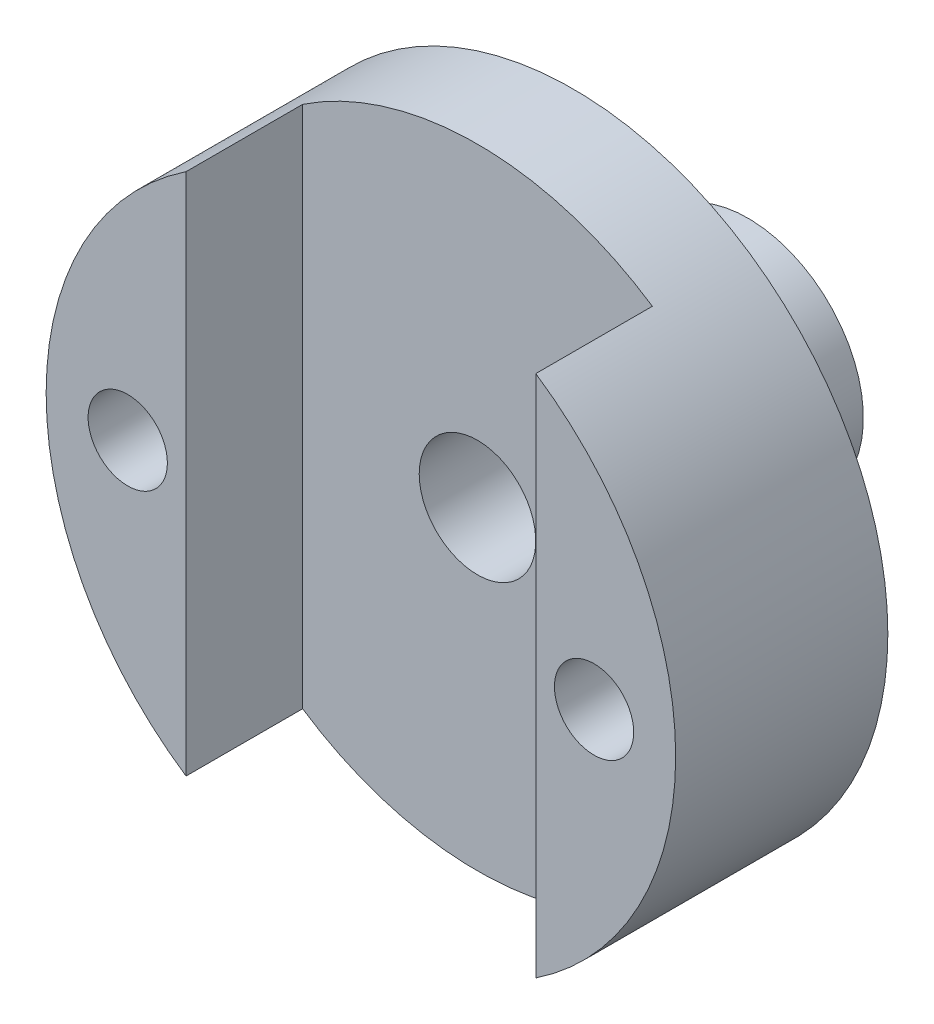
ISO-10303-21;
HEADER;
FILE_DESCRIPTION(('STEP AP214'),'2;1');
FILE_NAME('part.step','',(''),(''),'','','');
FILE_SCHEMA(('AUTOMOTIVE_DESIGN { 1 0 10303 214 1 1 1 1 }'));
ENDSEC;
DATA;
#1=APPLICATION_CONTEXT('core data for automotive mechanical design processes');
#2=APPLICATION_PROTOCOL_DEFINITION('international standard','automotive_design',2000,#1);
#3=PRODUCT_CONTEXT('',#1,'mechanical');
#4=PRODUCT('Part','Part','',(#3));
#5=PRODUCT_RELATED_PRODUCT_CATEGORY('part','',(#4));
#6=PRODUCT_DEFINITION_FORMATION('','',#4);
#7=PRODUCT_DEFINITION_CONTEXT('part definition',#1,'design');
#8=PRODUCT_DEFINITION('design','',#6,#7);
#9=PRODUCT_DEFINITION_SHAPE('','',#8);
#10=(LENGTH_UNIT() NAMED_UNIT(*) SI_UNIT(.MILLI.,.METRE.));
#11=(NAMED_UNIT(*) PLANE_ANGLE_UNIT() SI_UNIT($,.RADIAN.));
#12=(NAMED_UNIT(*) SI_UNIT($,.STERADIAN.) SOLID_ANGLE_UNIT());
#13=UNCERTAINTY_MEASURE_WITH_UNIT(LENGTH_MEASURE(1.E-05),#10,'distance_accuracy_value','');
#14=(GEOMETRIC_REPRESENTATION_CONTEXT(3) GLOBAL_UNCERTAINTY_ASSIGNED_CONTEXT((#13)) GLOBAL_UNIT_ASSIGNED_CONTEXT((#10,
#11,#12)) REPRESENTATION_CONTEXT('',''));
#15=CARTESIAN_POINT('',(0.,0.,0.));
#16=DIRECTION('',(0.,0.,1.));
#17=DIRECTION('',(1.,0.,0.));
#18=AXIS2_PLACEMENT_3D('',#15,#16,#17);
#19=CARTESIAN_POINT('',(0.,0.,9.525));
#20=DIRECTION('',(0.,0.,-1.));
#21=DIRECTION('',(-1.,0.,0.));
#22=AXIS2_PLACEMENT_3D('',#19,#20,#21);
#23=CYLINDRICAL_SURFACE('',#22,3.175);
#24=CARTESIAN_POINT('',(0.,0.,0.));
#25=DIRECTION('',(0.,0.,1.));
#26=DIRECTION('',(1.,0.,0.));
#27=AXIS2_PLACEMENT_3D('',#24,#25,#26);
#28=CIRCLE('',#27,3.175);
#29=CARTESIAN_POINT('',(-3.175,0.,0.));
#30=VERTEX_POINT('',#29);
#31=EDGE_CURVE('E123',#30,#30,#28,.T.);
#32=CARTESIAN_POINT('',(0.,0.,14.732));
#33=DIRECTION('',(0.,0.,1.));
#34=DIRECTION('',(1.,0.,0.));
#35=AXIS2_PLACEMENT_3D('',#32,#33,#34);
#36=CIRCLE('',#35,3.175);
#37=CARTESIAN_POINT('',(-3.175,0.,14.732));
#38=VERTEX_POINT('',#37);
#39=EDGE_CURVE('E115',#38,#38,#36,.T.);
#40=CARTESIAN_POINT('',(-3.175,0.,0.));
#41=CARTESIAN_POINT('',(-3.175,0.,0.153458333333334));
#42=CARTESIAN_POINT('',(-3.175,0.,0.306916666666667));
#43=CARTESIAN_POINT('',(-3.175,0.,0.613833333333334));
#44=CARTESIAN_POINT('',(-3.175,0.,0.767291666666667));
#45=CARTESIAN_POINT('',(-3.175,0.,1.07420833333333));
#46=CARTESIAN_POINT('',(-3.175,0.,1.22766666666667));
#47=CARTESIAN_POINT('',(-3.175,0.,1.53458333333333));
#48=CARTESIAN_POINT('',(-3.175,0.,1.68804166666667));
#49=CARTESIAN_POINT('',(-3.175,0.,1.99495833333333));
#50=CARTESIAN_POINT('',(-3.175,0.,2.14841666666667));
#51=CARTESIAN_POINT('',(-3.175,0.,2.45533333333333));
#52=CARTESIAN_POINT('',(-3.175,0.,2.60879166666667));
#53=CARTESIAN_POINT('',(-3.175,0.,2.91570833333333));
#54=CARTESIAN_POINT('',(-3.175,0.,3.06916666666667));
#55=CARTESIAN_POINT('',(-3.175,0.,3.37608333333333));
#56=CARTESIAN_POINT('',(-3.175,0.,3.52954166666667));
#57=CARTESIAN_POINT('',(-3.175,0.,3.83645833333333));
#58=CARTESIAN_POINT('',(-3.175,0.,3.98991666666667));
#59=CARTESIAN_POINT('',(-3.175,0.,4.29683333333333));
#60=CARTESIAN_POINT('',(-3.175,0.,4.45029166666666));
#61=CARTESIAN_POINT('',(-3.175,0.,4.75720833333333));
#62=CARTESIAN_POINT('',(-3.175,0.,4.91066666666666));
#63=CARTESIAN_POINT('',(-3.175,0.,5.21758333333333));
#64=CARTESIAN_POINT('',(-3.175,0.,5.37104166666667));
#65=CARTESIAN_POINT('',(-3.175,0.,5.67795833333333));
#66=CARTESIAN_POINT('',(-3.175,0.,5.83141666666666));
#67=CARTESIAN_POINT('',(-3.175,0.,6.13833333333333));
#68=CARTESIAN_POINT('',(-3.175,0.,6.29179166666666));
#69=CARTESIAN_POINT('',(-3.175,0.,6.59870833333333));
#70=CARTESIAN_POINT('',(-3.175,0.,6.75216666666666));
#71=CARTESIAN_POINT('',(-3.175,0.,7.05908333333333));
#72=CARTESIAN_POINT('',(-3.175,0.,7.21254166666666));
#73=CARTESIAN_POINT('',(-3.175,0.,7.51945833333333));
#74=CARTESIAN_POINT('',(-3.175,0.,7.67291666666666));
#75=CARTESIAN_POINT('',(-3.175,0.,7.97983333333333));
#76=CARTESIAN_POINT('',(-3.175,0.,8.13329166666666));
#77=CARTESIAN_POINT('',(-3.175,0.,8.44020833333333));
#78=CARTESIAN_POINT('',(-3.175,0.,8.59366666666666));
#79=CARTESIAN_POINT('',(-3.175,0.,8.90058333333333));
#80=CARTESIAN_POINT('',(-3.175,0.,9.05404166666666));
#81=CARTESIAN_POINT('',(-3.175,0.,9.36095833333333));
#82=CARTESIAN_POINT('',(-3.175,0.,9.51441666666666));
#83=CARTESIAN_POINT('',(-3.175,0.,9.82133333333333));
#84=CARTESIAN_POINT('',(-3.175,0.,9.97479166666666));
#85=CARTESIAN_POINT('',(-3.175,0.,10.2817083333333));
#86=CARTESIAN_POINT('',(-3.175,0.,10.4351666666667));
#87=CARTESIAN_POINT('',(-3.175,0.,10.7420833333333));
#88=CARTESIAN_POINT('',(-3.175,0.,10.8955416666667));
#89=CARTESIAN_POINT('',(-3.175,0.,11.2024583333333));
#90=CARTESIAN_POINT('',(-3.175,0.,11.3559166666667));
#91=CARTESIAN_POINT('',(-3.175,0.,11.6628333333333));
#92=CARTESIAN_POINT('',(-3.175,0.,11.8162916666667));
#93=CARTESIAN_POINT('',(-3.175,0.,12.1232083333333));
#94=CARTESIAN_POINT('',(-3.175,0.,12.2766666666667));
#95=CARTESIAN_POINT('',(-3.175,0.,12.5835833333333));
#96=CARTESIAN_POINT('',(-3.175,0.,12.7370416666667));
#97=CARTESIAN_POINT('',(-3.175,0.,13.0439583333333));
#98=CARTESIAN_POINT('',(-3.175,0.,13.1974166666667));
#99=CARTESIAN_POINT('',(-3.175,0.,13.5043333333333));
#100=CARTESIAN_POINT('',(-3.175,0.,13.6577916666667));
#101=CARTESIAN_POINT('',(-3.175,0.,13.9647083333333));
#102=CARTESIAN_POINT('',(-3.175,0.,14.1181666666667));
#103=CARTESIAN_POINT('',(-3.175,0.,14.4250833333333));
#104=CARTESIAN_POINT('',(-3.175,0.,14.5785416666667));
#105=CARTESIAN_POINT('',(-3.175,0.,14.732));
#106=B_SPLINE_CURVE_WITH_KNOTS('',3,(#40,#41,#42,#43,#44,#45,#46,#47,#48,#49,#50,#51,#52,#53,
#54,#55,#56,#57,#58,#59,#60,#61,#62,#63,#64,#65,#66,#67,#68,#69,#70,#71,#72,#73,#74,#75,#76,#77,
#78,#79,#80,#81,#82,#83,#84,#85,#86,#87,#88,#89,#90,#91,#92,#93,#94,#95,#96,#97,#98,#99,#100,
#101,#102,#103,#104,#105),.UNSPECIFIED.,.F.,.F.,(4,2,2,2,2,2,2,2,2,2,2,2,2,2,2,2,2,2,2,2,2,2,2,
2,2,2,2,2,2,2,2,2,4),(0.,0.460375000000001,0.92075,1.381125,1.8415,2.301875,2.76225,3.222625,
3.683,4.143375,4.60375,5.064125,5.5245,5.984875,6.44525,6.905625,7.366,7.826375,8.28675,
8.747125,9.2075,9.667875,10.12825,10.588625,11.049,11.509375,11.96975,12.430125,12.8905,
13.350875,13.81125,14.271625,14.732),.UNSPECIFIED.);
#107=EDGE_CURVE('BSEAM39',#30,#38,#106,.T.);
#108=ORIENTED_EDGE('',*,*,#31,.F.);
#109=ORIENTED_EDGE('',*,*,#39,.T.);
#110=ORIENTED_EDGE('',*,*,#107,.T.);
#111=ORIENTED_EDGE('',*,*,#107,.F.);
#112=EDGE_LOOP('',(#108,#110,#109,#111));
#113=FACE_BOUND('',#112,.T.);
#114=ADVANCED_FACE('F39',(#113),#23,.F.);
#115=CARTESIAN_POINT('',(0.,0.,21.082));
#116=DIRECTION('',(0.,0.,1.));
#117=DIRECTION('',(1.,0.,0.));
#118=AXIS2_PLACEMENT_3D('',#115,#116,#117);
#119=PLANE('',#118);
#120=CARTESIAN_POINT('',(-12.7,0.,21.082));
#121=DIRECTION('',(0.,0.,1.));
#122=DIRECTION('',(1.,0.,0.));
#123=AXIS2_PLACEMENT_3D('',#120,#121,#122);
#124=CIRCLE('',#123,2.159);
#125=CARTESIAN_POINT('',(-10.541,0.,21.082));
#126=VERTEX_POINT('',#125);
#127=EDGE_CURVE('E298',#126,#126,#124,.T.);
#128=ORIENTED_EDGE('',*,*,#127,.F.);
#129=EDGE_LOOP('',(#128));
#130=FACE_BOUND('',#129,.T.);
#131=CARTESIAN_POINT('',(0.,0.,21.082));
#132=DIRECTION('',(0.,0.,1.));
#133=DIRECTION('',(1.,0.,0.));
#134=AXIS2_PLACEMENT_3D('',#131,#132,#133);
#135=CIRCLE('',#134,17.145);
#136=CARTESIAN_POINT('',(-9.525,14.2557146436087,21.082));
#137=VERTEX_POINT('',#136);
#138=CARTESIAN_POINT('',(-9.525,-14.2557146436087,21.082));
#139=VERTEX_POINT('',#138);
#140=EDGE_CURVE('E83',#137,#139,#135,.T.);
#141=ORIENTED_EDGE('',*,*,#140,.T.);
#142=DIRECTION('',(0.,1.,0.));
#143=VECTOR('',#142,1.);
#144=CARTESIAN_POINT('',(-9.525,-66.0972168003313,21.082));
#145=LINE('',#144,#143);
#146=EDGE_CURVE('E113',#139,#137,#145,.T.);
#147=ORIENTED_EDGE('',*,*,#146,.T.);
#148=EDGE_LOOP('',(#141,#147));
#149=FACE_BOUND('',#148,.T.);
#150=ADVANCED_FACE('F136',(#130,#149),#119,.T.);
#151=CARTESIAN_POINT('',(12.7,0.,21.082));
#152=DIRECTION('',(0.,0.,1.));
#153=DIRECTION('',(1.,0.,0.));
#154=AXIS2_PLACEMENT_3D('',#151,#152,#153);
#155=CIRCLE('',#154,2.159);
#156=CARTESIAN_POINT('',(14.859,0.,21.082));
#157=VERTEX_POINT('',#156);
#158=EDGE_CURVE('E297',#157,#157,#155,.T.);
#159=ORIENTED_EDGE('',*,*,#158,.F.);
#160=EDGE_LOOP('',(#159));
#161=FACE_BOUND('',#160,.T.);
#162=CARTESIAN_POINT('',(9.525,-14.2557146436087,21.082));
#163=VERTEX_POINT('',#162);
#164=CARTESIAN_POINT('',(9.525,14.2557146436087,21.082));
#165=VERTEX_POINT('',#164);
#166=EDGE_CURVE('E74',#163,#165,#135,.T.);
#167=ORIENTED_EDGE('',*,*,#166,.T.);
#168=DIRECTION('',(0.,1.,0.));
#169=VECTOR('',#168,1.);
#170=CARTESIAN_POINT('',(9.525,-66.0972168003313,21.082));
#171=LINE('',#170,#169);
#172=EDGE_CURVE('E86',#163,#165,#171,.T.);
#173=ORIENTED_EDGE('',*,*,#172,.F.);
#174=EDGE_LOOP('',(#167,#173));
#175=FACE_BOUND('',#174,.T.);
#176=ADVANCED_FACE('F87',(#161,#175),#119,.T.);
#177=CARTESIAN_POINT('',(0.,0.,21.082));
#178=DIRECTION('',(0.,0.,-1.));
#179=DIRECTION('',(-1.,0.,0.));
#180=AXIS2_PLACEMENT_3D('',#177,#178,#179);
#181=CYLINDRICAL_SURFACE('',#180,17.145);
#182=CARTESIAN_POINT('',(0.,0.,9.525));
#183=DIRECTION('',(0.,0.,1.));
#184=DIRECTION('',(1.,0.,0.));
#185=AXIS2_PLACEMENT_3D('',#182,#183,#184);
#186=CIRCLE('',#185,17.145);
#187=CARTESIAN_POINT('',(17.145,0.,9.525));
#188=VERTEX_POINT('',#187);
#189=EDGE_CURVE('E84',#188,#188,#186,.T.);
#190=ORIENTED_EDGE('',*,*,#189,.T.);
#191=EDGE_LOOP('',(#190));
#192=FACE_BOUND('',#191,.T.);
#193=DIRECTION('',(0.,0.,-1.));
#194=VECTOR('',#193,1.);
#195=CARTESIAN_POINT('',(-9.525,14.2557146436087,21.082));
#196=LINE('',#195,#194);
#197=CARTESIAN_POINT('',(-9.525,14.2557146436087,14.732));
#198=VERTEX_POINT('',#197);
#199=EDGE_CURVE('E11',#198,#137,#196,.F.);
#200=ORIENTED_EDGE('',*,*,#199,.F.);
#201=CARTESIAN_POINT('',(0.,0.,14.732));
#202=DIRECTION('',(0.,0.,1.));
#203=DIRECTION('',(1.,0.,0.));
#204=AXIS2_PLACEMENT_3D('',#201,#202,#203);
#205=CIRCLE('',#204,17.145);
#206=CARTESIAN_POINT('',(9.525,14.2557146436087,14.732));
#207=VERTEX_POINT('',#206);
#208=EDGE_CURVE('E47',#207,#198,#205,.T.);
#209=ORIENTED_EDGE('',*,*,#208,.F.);
#210=DIRECTION('',(0.,0.,-1.));
#211=VECTOR('',#210,1.);
#212=CARTESIAN_POINT('',(9.525,14.2557146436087,21.082));
#213=LINE('',#212,#211);
#214=EDGE_CURVE('E80',#165,#207,#213,.T.);
#215=ORIENTED_EDGE('',*,*,#214,.F.);
#216=ORIENTED_EDGE('',*,*,#166,.F.);
#217=DIRECTION('',(0.,0.,-1.));
#218=VECTOR('',#217,1.);
#219=CARTESIAN_POINT('',(9.525,-14.2557146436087,21.082));
#220=LINE('',#219,#218);
#221=CARTESIAN_POINT('',(9.525,-14.2557146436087,14.732));
#222=VERTEX_POINT('',#221);
#223=EDGE_CURVE('E78',#222,#163,#220,.F.);
#224=ORIENTED_EDGE('',*,*,#223,.F.);
#225=CARTESIAN_POINT('',(-9.525,-14.2557146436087,14.732));
#226=VERTEX_POINT('',#225);
#227=EDGE_CURVE('E95',#226,#222,#205,.T.);
#228=ORIENTED_EDGE('',*,*,#227,.F.);
#229=DIRECTION('',(0.,0.,-1.));
#230=VECTOR('',#229,1.);
#231=CARTESIAN_POINT('',(-9.525,-14.2557146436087,21.082));
#232=LINE('',#231,#230);
#233=EDGE_CURVE('E98',#139,#226,#232,.T.);
#234=ORIENTED_EDGE('',*,*,#233,.F.);
#235=ORIENTED_EDGE('',*,*,#140,.F.);
#236=EDGE_LOOP('',(#200,#209,#215,#216,#224,#228,#234,#235));
#237=FACE_BOUND('',#236,.T.);
#238=ADVANCED_FACE('F76',(#192,#237),#181,.T.);
#239=CARTESIAN_POINT('',(0.,0.,0.));
#240=DIRECTION('',(0.,0.,1.));
#241=DIRECTION('',(1.,0.,0.));
#242=AXIS2_PLACEMENT_3D('',#239,#240,#241);
#243=PLANE('',#242);
#244=CARTESIAN_POINT('',(0.,0.,0.));
#245=DIRECTION('',(0.,0.,1.));
#246=DIRECTION('',(1.,0.,0.));
#247=AXIS2_PLACEMENT_3D('',#244,#245,#246);
#248=CIRCLE('',#247,6.2865);
#249=CARTESIAN_POINT('',(-6.2865,0.,0.));
#250=VERTEX_POINT('',#249);
#251=EDGE_CURVE('E101',#250,#250,#248,.T.);
#252=ORIENTED_EDGE('',*,*,#251,.F.);
#253=EDGE_LOOP('',(#252));
#254=FACE_BOUND('',#253,.T.);
#255=ORIENTED_EDGE('',*,*,#31,.T.);
#256=EDGE_LOOP('',(#255));
#257=FACE_BOUND('',#256,.T.);
#258=ADVANCED_FACE('F129',(#254,#257),#243,.F.);
#259=CARTESIAN_POINT('',(0.,0.,9.525));
#260=DIRECTION('',(0.,0.,-1.));
#261=DIRECTION('',(-1.,0.,0.));
#262=AXIS2_PLACEMENT_3D('',#259,#260,#261);
#263=CYLINDRICAL_SURFACE('',#262,6.2865);
#264=CARTESIAN_POINT('',(0.,0.,9.525));
#265=DIRECTION('',(0.,0.,1.));
#266=DIRECTION('',(1.,0.,0.));
#267=AXIS2_PLACEMENT_3D('',#264,#265,#266);
#268=CIRCLE('',#267,6.2865);
#269=CARTESIAN_POINT('',(-6.2865,0.,9.525));
#270=VERTEX_POINT('',#269);
#271=EDGE_CURVE('E96',#270,#270,#268,.T.);
#272=CARTESIAN_POINT('',(-6.2865,0.,9.525));
#273=CARTESIAN_POINT('',(-6.2865,0.,9.42578125));
#274=CARTESIAN_POINT('',(-6.2865,0.,9.3265625));
#275=CARTESIAN_POINT('',(-6.2865,0.,9.128125));
#276=CARTESIAN_POINT('',(-6.2865,0.,9.02890625));
#277=CARTESIAN_POINT('',(-6.2865,0.,8.83046875));
#278=CARTESIAN_POINT('',(-6.2865,0.,8.73125));
#279=CARTESIAN_POINT('',(-6.2865,0.,8.5328125));
#280=CARTESIAN_POINT('',(-6.2865,0.,8.43359375));
#281=CARTESIAN_POINT('',(-6.2865,0.,8.23515625));
#282=CARTESIAN_POINT('',(-6.2865,0.,8.1359375));
#283=CARTESIAN_POINT('',(-6.2865,0.,7.9375));
#284=CARTESIAN_POINT('',(-6.2865,0.,7.83828125));
#285=CARTESIAN_POINT('',(-6.2865,0.,7.63984375));
#286=CARTESIAN_POINT('',(-6.2865,0.,7.540625));
#287=CARTESIAN_POINT('',(-6.2865,0.,7.3421875));
#288=CARTESIAN_POINT('',(-6.2865,0.,7.24296875));
#289=CARTESIAN_POINT('',(-6.2865,0.,7.04453125));
#290=CARTESIAN_POINT('',(-6.2865,0.,6.9453125));
#291=CARTESIAN_POINT('',(-6.2865,0.,6.746875));
#292=CARTESIAN_POINT('',(-6.2865,0.,6.64765625));
#293=CARTESIAN_POINT('',(-6.2865,0.,6.44921875));
#294=CARTESIAN_POINT('',(-6.2865,0.,6.35));
#295=CARTESIAN_POINT('',(-6.2865,0.,6.1515625));
#296=CARTESIAN_POINT('',(-6.2865,0.,6.05234375));
#297=CARTESIAN_POINT('',(-6.2865,0.,5.85390625));
#298=CARTESIAN_POINT('',(-6.2865,0.,5.7546875));
#299=CARTESIAN_POINT('',(-6.2865,0.,5.55625));
#300=CARTESIAN_POINT('',(-6.2865,0.,5.45703125));
#301=CARTESIAN_POINT('',(-6.2865,0.,5.25859375));
#302=CARTESIAN_POINT('',(-6.2865,0.,5.159375));
#303=CARTESIAN_POINT('',(-6.2865,0.,4.9609375));
#304=CARTESIAN_POINT('',(-6.2865,0.,4.86171875));
#305=CARTESIAN_POINT('',(-6.2865,0.,4.66328125));
#306=CARTESIAN_POINT('',(-6.2865,0.,4.5640625));
#307=CARTESIAN_POINT('',(-6.2865,0.,4.365625));
#308=CARTESIAN_POINT('',(-6.2865,0.,4.26640625));
#309=CARTESIAN_POINT('',(-6.2865,0.,4.06796875));
#310=CARTESIAN_POINT('',(-6.2865,0.,3.96875));
#311=CARTESIAN_POINT('',(-6.2865,0.,3.7703125));
#312=CARTESIAN_POINT('',(-6.2865,0.,3.67109375));
#313=CARTESIAN_POINT('',(-6.2865,0.,3.47265625));
#314=CARTESIAN_POINT('',(-6.2865,0.,3.3734375));
#315=CARTESIAN_POINT('',(-6.2865,0.,3.175));
#316=CARTESIAN_POINT('',(-6.2865,0.,3.07578125));
#317=CARTESIAN_POINT('',(-6.2865,0.,2.87734375));
#318=CARTESIAN_POINT('',(-6.2865,0.,2.778125));
#319=CARTESIAN_POINT('',(-6.2865,0.,2.5796875));
#320=CARTESIAN_POINT('',(-6.2865,0.,2.48046875));
#321=CARTESIAN_POINT('',(-6.2865,0.,2.28203125));
#322=CARTESIAN_POINT('',(-6.2865,0.,2.1828125));
#323=CARTESIAN_POINT('',(-6.2865,0.,1.984375));
#324=CARTESIAN_POINT('',(-6.2865,0.,1.88515625));
#325=CARTESIAN_POINT('',(-6.2865,0.,1.68671875));
#326=CARTESIAN_POINT('',(-6.2865,0.,1.5875));
#327=CARTESIAN_POINT('',(-6.2865,0.,1.3890625));
#328=CARTESIAN_POINT('',(-6.2865,0.,1.28984375));
#329=CARTESIAN_POINT('',(-6.2865,0.,1.09140625));
#330=CARTESIAN_POINT('',(-6.2865,0.,0.992187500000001));
#331=CARTESIAN_POINT('',(-6.2865,0.,0.793750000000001));
#332=CARTESIAN_POINT('',(-6.2865,0.,0.69453125));
#333=CARTESIAN_POINT('',(-6.2865,0.,0.49609375));
#334=CARTESIAN_POINT('',(-6.2865,0.,0.396875));
#335=CARTESIAN_POINT('',(-6.2865,0.,0.1984375));
#336=CARTESIAN_POINT('',(-6.2865,0.,0.0992187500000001));
#337=CARTESIAN_POINT('',(-6.2865,0.,0.));
#338=B_SPLINE_CURVE_WITH_KNOTS('',3,(#272,#273,#274,#275,#276,#277,#278,#279,#280,#281,#282,
#283,#284,#285,#286,#287,#288,#289,#290,#291,#292,#293,#294,#295,#296,#297,#298,#299,#300,#301,
#302,#303,#304,#305,#306,#307,#308,#309,#310,#311,#312,#313,#314,#315,#316,#317,#318,#319,#320,
#321,#322,#323,#324,#325,#326,#327,#328,#329,#330,#331,#332,#333,#334,#335,#336,#337),
.UNSPECIFIED.,.F.,.F.,(4,2,2,2,2,2,2,2,2,2,2,2,2,2,2,2,2,2,2,2,2,2,2,2,2,2,2,2,2,2,2,2,4),(0.,
0.29765625,0.5953125,0.892968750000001,1.190625,1.48828125,1.7859375,2.08359375,2.38125,
2.67890625,2.9765625,3.27421875,3.571875,3.86953125,4.1671875,4.46484375,4.7625,5.06015625,
5.3578125,5.65546875,5.953125,6.25078125,6.5484375,6.84609375,7.14375,7.44140625,7.7390625,
8.03671875,8.334375,8.63203125,8.9296875,9.22734375,9.525),.UNSPECIFIED.);
#339=EDGE_CURVE('BSEAM41',#270,#250,#338,.T.);
#340=ORIENTED_EDGE('',*,*,#271,.F.);
#341=ORIENTED_EDGE('',*,*,#251,.T.);
#342=ORIENTED_EDGE('',*,*,#339,.T.);
#343=ORIENTED_EDGE('',*,*,#339,.F.);
#344=EDGE_LOOP('',(#340,#342,#341,#343));
#345=FACE_BOUND('',#344,.T.);
#346=ADVANCED_FACE('F41',(#345),#263,.T.);
#347=CARTESIAN_POINT('',(0.,0.,9.525));
#348=DIRECTION('',(0.,0.,1.));
#349=DIRECTION('',(1.,0.,0.));
#350=AXIS2_PLACEMENT_3D('',#347,#348,#349);
#351=PLANE('',#350);
#352=ORIENTED_EDGE('',*,*,#189,.F.);
#353=EDGE_LOOP('',(#352));
#354=FACE_BOUND('',#353,.T.);
#355=ORIENTED_EDGE('',*,*,#271,.T.);
#356=EDGE_LOOP('',(#355));
#357=FACE_BOUND('',#356,.T.);
#358=ADVANCED_FACE('F149',(#354,#357),#351,.F.);
#359=CARTESIAN_POINT('',(-9.525,-66.0972168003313,21.082));
#360=DIRECTION('',(1.,0.,0.));
#361=DIRECTION('',(0.,0.,-1.));
#362=AXIS2_PLACEMENT_3D('',#359,#360,#361);
#363=PLANE('',#362);
#364=ORIENTED_EDGE('',*,*,#146,.F.);
#365=ORIENTED_EDGE('',*,*,#233,.T.);
#366=DIRECTION('',(0.,1.,0.));
#367=VECTOR('',#366,1.);
#368=CARTESIAN_POINT('',(-9.525,-66.0972168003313,14.732));
#369=LINE('',#368,#367);
#370=EDGE_CURVE('E89',#226,#198,#369,.T.);
#371=ORIENTED_EDGE('',*,*,#370,.T.);
#372=ORIENTED_EDGE('',*,*,#199,.T.);
#373=EDGE_LOOP('',(#364,#365,#371,#372));
#374=FACE_BOUND('',#373,.T.);
#375=ADVANCED_FACE('F112',(#374),#363,.T.);
#376=CARTESIAN_POINT('',(-9.525,-66.0972168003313,14.732));
#377=DIRECTION('',(0.,0.,1.));
#378=DIRECTION('',(1.,0.,0.));
#379=AXIS2_PLACEMENT_3D('',#376,#377,#378);
#380=PLANE('',#379);
#381=ORIENTED_EDGE('',*,*,#39,.F.);
#382=EDGE_LOOP('',(#381));
#383=FACE_BOUND('',#382,.T.);
#384=DIRECTION('',(0.,1.,0.));
#385=VECTOR('',#384,1.);
#386=CARTESIAN_POINT('',(9.525,-66.0972168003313,14.732));
#387=LINE('',#386,#385);
#388=EDGE_CURVE('E90',#222,#207,#387,.T.);
#389=ORIENTED_EDGE('',*,*,#388,.T.);
#390=ORIENTED_EDGE('',*,*,#208,.T.);
#391=ORIENTED_EDGE('',*,*,#370,.F.);
#392=ORIENTED_EDGE('',*,*,#227,.T.);
#393=EDGE_LOOP('',(#389,#390,#391,#392));
#394=FACE_BOUND('',#393,.T.);
#395=ADVANCED_FACE('F109',(#383,#394),#380,.T.);
#396=CARTESIAN_POINT('',(9.525,-66.0972168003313,14.732));
#397=DIRECTION('',(-1.,0.,0.));
#398=DIRECTION('',(0.,0.,1.));
#399=AXIS2_PLACEMENT_3D('',#396,#397,#398);
#400=PLANE('',#399);
#401=ORIENTED_EDGE('',*,*,#172,.T.);
#402=ORIENTED_EDGE('',*,*,#214,.T.);
#403=ORIENTED_EDGE('',*,*,#388,.F.);
#404=ORIENTED_EDGE('',*,*,#223,.T.);
#405=EDGE_LOOP('',(#401,#402,#403,#404));
#406=FACE_BOUND('',#405,.T.);
#407=ADVANCED_FACE('F93',(#406),#400,.T.);
#408=CARTESIAN_POINT('',(12.7,0.,11.557));
#409=DIRECTION('',(0.,0.,1.));
#410=DIRECTION('',(1.,0.,0.));
#411=AXIS2_PLACEMENT_3D('',#408,#409,#410);
#412=CYLINDRICAL_SURFACE('',#411,2.159);
#413=CARTESIAN_POINT('',(12.7,0.,11.557));
#414=DIRECTION('',(0.,0.,1.));
#415=DIRECTION('',(1.,0.,0.));
#416=AXIS2_PLACEMENT_3D('',#413,#414,#415);
#417=CIRCLE('',#416,2.159);
#418=CARTESIAN_POINT('',(14.859,0.,11.557));
#419=VERTEX_POINT('',#418);
#420=EDGE_CURVE('E301',#419,#419,#417,.T.);
#421=CARTESIAN_POINT('',(14.859,0.,11.557));
#422=CARTESIAN_POINT('',(14.859,0.,11.65621875));
#423=CARTESIAN_POINT('',(14.859,0.,11.7554375));
#424=CARTESIAN_POINT('',(14.859,0.,11.953875));
#425=CARTESIAN_POINT('',(14.859,0.,12.05309375));
#426=CARTESIAN_POINT('',(14.859,0.,12.25153125));
#427=CARTESIAN_POINT('',(14.859,0.,12.35075));
#428=CARTESIAN_POINT('',(14.859,0.,12.5491875));
#429=CARTESIAN_POINT('',(14.859,0.,12.64840625));
#430=CARTESIAN_POINT('',(14.859,0.,12.84684375));
#431=CARTESIAN_POINT('',(14.859,0.,12.9460625));
#432=CARTESIAN_POINT('',(14.859,0.,13.1445));
#433=CARTESIAN_POINT('',(14.859,0.,13.24371875));
#434=CARTESIAN_POINT('',(14.859,0.,13.44215625));
#435=CARTESIAN_POINT('',(14.859,0.,13.541375));
#436=CARTESIAN_POINT('',(14.859,0.,13.7398125));
#437=CARTESIAN_POINT('',(14.859,0.,13.83903125));
#438=CARTESIAN_POINT('',(14.859,0.,14.03746875));
#439=CARTESIAN_POINT('',(14.859,0.,14.1366875));
#440=CARTESIAN_POINT('',(14.859,0.,14.335125));
#441=CARTESIAN_POINT('',(14.859,0.,14.43434375));
#442=CARTESIAN_POINT('',(14.859,0.,14.63278125));
#443=CARTESIAN_POINT('',(14.859,0.,14.732));
#444=CARTESIAN_POINT('',(14.859,0.,14.9304375));
#445=CARTESIAN_POINT('',(14.859,0.,15.02965625));
#446=CARTESIAN_POINT('',(14.859,0.,15.22809375));
#447=CARTESIAN_POINT('',(14.859,0.,15.3273125));
#448=CARTESIAN_POINT('',(14.859,0.,15.52575));
#449=CARTESIAN_POINT('',(14.859,0.,15.62496875));
#450=CARTESIAN_POINT('',(14.859,0.,15.82340625));
#451=CARTESIAN_POINT('',(14.859,0.,15.922625));
#452=CARTESIAN_POINT('',(14.859,0.,16.1210625));
#453=CARTESIAN_POINT('',(14.859,0.,16.22028125));
#454=CARTESIAN_POINT('',(14.859,0.,16.41871875));
#455=CARTESIAN_POINT('',(14.859,0.,16.5179375));
#456=CARTESIAN_POINT('',(14.859,0.,16.716375));
#457=CARTESIAN_POINT('',(14.859,0.,16.81559375));
#458=CARTESIAN_POINT('',(14.859,0.,17.01403125));
#459=CARTESIAN_POINT('',(14.859,0.,17.11325));
#460=CARTESIAN_POINT('',(14.859,0.,17.3116875));
#461=CARTESIAN_POINT('',(14.859,0.,17.41090625));
#462=CARTESIAN_POINT('',(14.859,0.,17.60934375));
#463=CARTESIAN_POINT('',(14.859,0.,17.7085625));
#464=CARTESIAN_POINT('',(14.859,0.,17.907));
#465=CARTESIAN_POINT('',(14.859,0.,18.00621875));
#466=CARTESIAN_POINT('',(14.859,0.,18.20465625));
#467=CARTESIAN_POINT('',(14.859,0.,18.303875));
#468=CARTESIAN_POINT('',(14.859,0.,18.5023125));
#469=CARTESIAN_POINT('',(14.859,0.,18.60153125));
#470=CARTESIAN_POINT('',(14.859,0.,18.79996875));
#471=CARTESIAN_POINT('',(14.859,0.,18.8991875));
#472=CARTESIAN_POINT('',(14.859,0.,19.097625));
#473=CARTESIAN_POINT('',(14.859,0.,19.19684375));
#474=CARTESIAN_POINT('',(14.859,0.,19.39528125));
#475=CARTESIAN_POINT('',(14.859,0.,19.4945));
#476=CARTESIAN_POINT('',(14.859,0.,19.6929375));
#477=CARTESIAN_POINT('',(14.859,0.,19.79215625));
#478=CARTESIAN_POINT('',(14.859,0.,19.99059375));
#479=CARTESIAN_POINT('',(14.859,0.,20.0898125));
#480=CARTESIAN_POINT('',(14.859,0.,20.28825));
#481=CARTESIAN_POINT('',(14.859,0.,20.38746875));
#482=CARTESIAN_POINT('',(14.859,0.,20.58590625));
#483=CARTESIAN_POINT('',(14.859,0.,20.685125));
#484=CARTESIAN_POINT('',(14.859,0.,20.8835625));
#485=CARTESIAN_POINT('',(14.859,0.,20.98278125));
#486=CARTESIAN_POINT('',(14.859,0.,21.082));
#487=B_SPLINE_CURVE_WITH_KNOTS('',3,(#421,#422,#423,#424,#425,#426,#427,#428,#429,#430,#431,
#432,#433,#434,#435,#436,#437,#438,#439,#440,#441,#442,#443,#444,#445,#446,#447,#448,#449,#450,
#451,#452,#453,#454,#455,#456,#457,#458,#459,#460,#461,#462,#463,#464,#465,#466,#467,#468,#469,
#470,#471,#472,#473,#474,#475,#476,#477,#478,#479,#480,#481,#482,#483,#484,#485,#486),
.UNSPECIFIED.,.F.,.F.,(4,2,2,2,2,2,2,2,2,2,2,2,2,2,2,2,2,2,2,2,2,2,2,2,2,2,2,2,2,2,2,2,4),(0.,
0.29765625,0.5953125,0.892968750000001,1.190625,1.48828125,1.7859375,2.08359375,2.38125,
2.67890625,2.9765625,3.27421875,3.571875,3.86953125,4.1671875,4.46484375,4.7625,5.06015625,
5.3578125,5.65546875,5.953125,6.25078125,6.5484375,6.84609375,7.14375,7.44140625,7.7390625,
8.03671875,8.334375,8.63203125,8.9296875,9.22734375,9.525),.UNSPECIFIED.);
#488=EDGE_CURVE('BSEAM146',#419,#157,#487,.T.);
#489=ORIENTED_EDGE('',*,*,#420,.F.);
#490=ORIENTED_EDGE('',*,*,#158,.T.);
#491=ORIENTED_EDGE('',*,*,#488,.T.);
#492=ORIENTED_EDGE('',*,*,#488,.F.);
#493=EDGE_LOOP('',(#489,#491,#490,#492));
#494=FACE_BOUND('',#493,.T.);
#495=ADVANCED_FACE('F146',(#494),#412,.F.);
#496=CARTESIAN_POINT('',(12.7,0.,11.557));
#497=DIRECTION('',(0.,0.,1.));
#498=DIRECTION('',(1.,0.,0.));
#499=AXIS2_PLACEMENT_3D('',#496,#497,#498);
#500=PLANE('',#499);
#501=ORIENTED_EDGE('',*,*,#420,.T.);
#502=EDGE_LOOP('',(#501));
#503=FACE_BOUND('',#502,.T.);
#504=ADVANCED_FACE('F148',(#503),#500,.T.);
#505=CARTESIAN_POINT('',(-12.7,0.,11.557));
#506=DIRECTION('',(0.,0.,1.));
#507=DIRECTION('',(1.,0.,0.));
#508=AXIS2_PLACEMENT_3D('',#505,#506,#507);
#509=CYLINDRICAL_SURFACE('',#508,2.159);
#510=CARTESIAN_POINT('',(-12.7,0.,11.557));
#511=DIRECTION('',(0.,0.,1.));
#512=DIRECTION('',(1.,0.,0.));
#513=AXIS2_PLACEMENT_3D('',#510,#511,#512);
#514=CIRCLE('',#513,2.159);
#515=CARTESIAN_POINT('',(-10.541,0.,11.557));
#516=VERTEX_POINT('',#515);
#517=EDGE_CURVE('E296',#516,#516,#514,.T.);
#518=CARTESIAN_POINT('',(-10.541,0.,11.557));
#519=CARTESIAN_POINT('',(-10.541,0.,11.65621875));
#520=CARTESIAN_POINT('',(-10.541,0.,11.7554375));
#521=CARTESIAN_POINT('',(-10.541,0.,11.953875));
#522=CARTESIAN_POINT('',(-10.541,0.,12.05309375));
#523=CARTESIAN_POINT('',(-10.541,0.,12.25153125));
#524=CARTESIAN_POINT('',(-10.541,0.,12.35075));
#525=CARTESIAN_POINT('',(-10.541,0.,12.5491875));
#526=CARTESIAN_POINT('',(-10.541,0.,12.64840625));
#527=CARTESIAN_POINT('',(-10.541,0.,12.84684375));
#528=CARTESIAN_POINT('',(-10.541,0.,12.9460625));
#529=CARTESIAN_POINT('',(-10.541,0.,13.1445));
#530=CARTESIAN_POINT('',(-10.541,0.,13.24371875));
#531=CARTESIAN_POINT('',(-10.541,0.,13.44215625));
#532=CARTESIAN_POINT('',(-10.541,0.,13.541375));
#533=CARTESIAN_POINT('',(-10.541,0.,13.7398125));
#534=CARTESIAN_POINT('',(-10.541,0.,13.83903125));
#535=CARTESIAN_POINT('',(-10.541,0.,14.03746875));
#536=CARTESIAN_POINT('',(-10.541,0.,14.1366875));
#537=CARTESIAN_POINT('',(-10.541,0.,14.335125));
#538=CARTESIAN_POINT('',(-10.541,0.,14.43434375));
#539=CARTESIAN_POINT('',(-10.541,0.,14.63278125));
#540=CARTESIAN_POINT('',(-10.541,0.,14.732));
#541=CARTESIAN_POINT('',(-10.541,0.,14.9304375));
#542=CARTESIAN_POINT('',(-10.541,0.,15.02965625));
#543=CARTESIAN_POINT('',(-10.541,0.,15.22809375));
#544=CARTESIAN_POINT('',(-10.541,0.,15.3273125));
#545=CARTESIAN_POINT('',(-10.541,0.,15.52575));
#546=CARTESIAN_POINT('',(-10.541,0.,15.62496875));
#547=CARTESIAN_POINT('',(-10.541,0.,15.82340625));
#548=CARTESIAN_POINT('',(-10.541,0.,15.922625));
#549=CARTESIAN_POINT('',(-10.541,0.,16.1210625));
#550=CARTESIAN_POINT('',(-10.541,0.,16.22028125));
#551=CARTESIAN_POINT('',(-10.541,0.,16.41871875));
#552=CARTESIAN_POINT('',(-10.541,0.,16.5179375));
#553=CARTESIAN_POINT('',(-10.541,0.,16.716375));
#554=CARTESIAN_POINT('',(-10.541,0.,16.81559375));
#555=CARTESIAN_POINT('',(-10.541,0.,17.01403125));
#556=CARTESIAN_POINT('',(-10.541,0.,17.11325));
#557=CARTESIAN_POINT('',(-10.541,0.,17.3116875));
#558=CARTESIAN_POINT('',(-10.541,0.,17.41090625));
#559=CARTESIAN_POINT('',(-10.541,0.,17.60934375));
#560=CARTESIAN_POINT('',(-10.541,0.,17.7085625));
#561=CARTESIAN_POINT('',(-10.541,0.,17.907));
#562=CARTESIAN_POINT('',(-10.541,0.,18.00621875));
#563=CARTESIAN_POINT('',(-10.541,0.,18.20465625));
#564=CARTESIAN_POINT('',(-10.541,0.,18.303875));
#565=CARTESIAN_POINT('',(-10.541,0.,18.5023125));
#566=CARTESIAN_POINT('',(-10.541,0.,18.60153125));
#567=CARTESIAN_POINT('',(-10.541,0.,18.79996875));
#568=CARTESIAN_POINT('',(-10.541,0.,18.8991875));
#569=CARTESIAN_POINT('',(-10.541,0.,19.097625));
#570=CARTESIAN_POINT('',(-10.541,0.,19.19684375));
#571=CARTESIAN_POINT('',(-10.541,0.,19.39528125));
#572=CARTESIAN_POINT('',(-10.541,0.,19.4945));
#573=CARTESIAN_POINT('',(-10.541,0.,19.6929375));
#574=CARTESIAN_POINT('',(-10.541,0.,19.79215625));
#575=CARTESIAN_POINT('',(-10.541,0.,19.99059375));
#576=CARTESIAN_POINT('',(-10.541,0.,20.0898125));
#577=CARTESIAN_POINT('',(-10.541,0.,20.28825));
#578=CARTESIAN_POINT('',(-10.541,0.,20.38746875));
#579=CARTESIAN_POINT('',(-10.541,0.,20.58590625));
#580=CARTESIAN_POINT('',(-10.541,0.,20.685125));
#581=CARTESIAN_POINT('',(-10.541,0.,20.8835625));
#582=CARTESIAN_POINT('',(-10.541,0.,20.98278125));
#583=CARTESIAN_POINT('',(-10.541,0.,21.082));
#584=B_SPLINE_CURVE_WITH_KNOTS('',3,(#518,#519,#520,#521,#522,#523,#524,#525,#526,#527,#528,
#529,#530,#531,#532,#533,#534,#535,#536,#537,#538,#539,#540,#541,#542,#543,#544,#545,#546,#547,
#548,#549,#550,#551,#552,#553,#554,#555,#556,#557,#558,#559,#560,#561,#562,#563,#564,#565,#566,
#567,#568,#569,#570,#571,#572,#573,#574,#575,#576,#577,#578,#579,#580,#581,#582,#583),
.UNSPECIFIED.,.F.,.F.,(4,2,2,2,2,2,2,2,2,2,2,2,2,2,2,2,2,2,2,2,2,2,2,2,2,2,2,2,2,2,2,2,4),(0.,
0.29765625,0.5953125,0.892968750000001,1.190625,1.48828125,1.7859375,2.08359375,2.38125,
2.67890625,2.9765625,3.27421875,3.571875,3.86953125,4.1671875,4.46484375,4.7625,5.06015625,
5.3578125,5.65546875,5.953125,6.25078125,6.5484375,6.84609375,7.14375,7.44140625,7.7390625,
8.03671875,8.334375,8.63203125,8.9296875,9.22734375,9.525),.UNSPECIFIED.);
#585=EDGE_CURVE('BSEAM210',#516,#126,#584,.T.);
#586=ORIENTED_EDGE('',*,*,#517,.F.);
#587=ORIENTED_EDGE('',*,*,#127,.T.);
#588=ORIENTED_EDGE('',*,*,#585,.T.);
#589=ORIENTED_EDGE('',*,*,#585,.F.);
#590=EDGE_LOOP('',(#586,#588,#587,#589));
#591=FACE_BOUND('',#590,.T.);
#592=ADVANCED_FACE('F210',(#591),#509,.F.);
#593=CARTESIAN_POINT('',(-12.7,0.,11.557));
#594=DIRECTION('',(0.,0.,1.));
#595=DIRECTION('',(1.,0.,0.));
#596=AXIS2_PLACEMENT_3D('',#593,#594,#595);
#597=PLANE('',#596);
#598=ORIENTED_EDGE('',*,*,#517,.T.);
#599=EDGE_LOOP('',(#598));
#600=FACE_BOUND('',#599,.T.);
#601=ADVANCED_FACE('F202',(#600),#597,.T.);
#602=CLOSED_SHELL('',(#114,#150,#176,#238,#258,#346,#358,#375,#395,#407,#495,#504,#592,#601));
#603=MANIFOLD_SOLID_BREP('B2',#602);
#604=ADVANCED_BREP_SHAPE_REPRESENTATION('',(#18,#603),#14);
#605=SHAPE_DEFINITION_REPRESENTATION(#9,#604);
ENDSEC;
END-ISO-10303-21;
